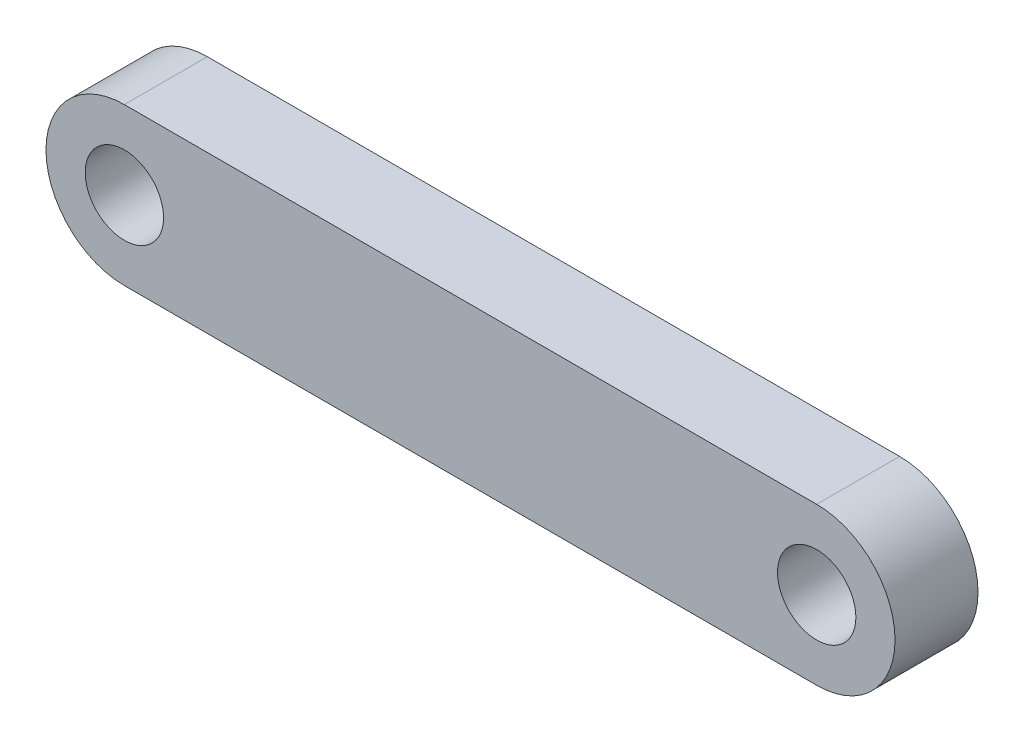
ISO-10303-21;
HEADER;
FILE_DESCRIPTION(('STEP AP214'),'2;1');
FILE_NAME('part.step','',(''),(''),'','','');
FILE_SCHEMA(('AUTOMOTIVE_DESIGN { 1 0 10303 214 1 1 1 1 }'));
ENDSEC;
DATA;
#1=APPLICATION_CONTEXT('core data for automotive mechanical design processes');
#2=APPLICATION_PROTOCOL_DEFINITION('international standard','automotive_design',2000,#1);
#3=PRODUCT_CONTEXT('',#1,'mechanical');
#4=PRODUCT('Part','Part','',(#3));
#5=PRODUCT_RELATED_PRODUCT_CATEGORY('part','',(#4));
#6=PRODUCT_DEFINITION_FORMATION('','',#4);
#7=PRODUCT_DEFINITION_CONTEXT('part definition',#1,'design');
#8=PRODUCT_DEFINITION('design','',#6,#7);
#9=PRODUCT_DEFINITION_SHAPE('','',#8);
#10=(LENGTH_UNIT() NAMED_UNIT(*) SI_UNIT(.MILLI.,.METRE.));
#11=(NAMED_UNIT(*) PLANE_ANGLE_UNIT() SI_UNIT($,.RADIAN.));
#12=(NAMED_UNIT(*) SI_UNIT($,.STERADIAN.) SOLID_ANGLE_UNIT());
#13=UNCERTAINTY_MEASURE_WITH_UNIT(LENGTH_MEASURE(1.E-05),#10,'distance_accuracy_value','');
#14=(GEOMETRIC_REPRESENTATION_CONTEXT(3) GLOBAL_UNCERTAINTY_ASSIGNED_CONTEXT((#13)) GLOBAL_UNIT_ASSIGNED_CONTEXT((#10,
#11,#12)) REPRESENTATION_CONTEXT('',''));
#15=CARTESIAN_POINT('',(0.,0.,0.));
#16=DIRECTION('',(0.,0.,1.));
#17=DIRECTION('',(1.,0.,0.));
#18=AXIS2_PLACEMENT_3D('',#15,#16,#17);
#19=CARTESIAN_POINT('',(-53.,0.,12.7));
#20=DIRECTION('',(0.,0.,1.));
#21=DIRECTION('',(1.,0.,0.));
#22=AXIS2_PLACEMENT_3D('',#19,#20,#21);
#23=PLANE('',#22);
#24=CARTESIAN_POINT('',(-53.,0.,12.7));
#25=DIRECTION('',(0.,0.,1.));
#26=DIRECTION('',(1.,0.,0.));
#27=AXIS2_PLACEMENT_3D('',#24,#25,#26);
#28=CIRCLE('',#27,5.99999999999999);
#29=CARTESIAN_POINT('',(-47.,0.,12.7));
#30=VERTEX_POINT('',#29);
#31=EDGE_CURVE('E118',#30,#30,#28,.T.);
#32=ORIENTED_EDGE('',*,*,#31,.F.);
#33=EDGE_LOOP('',(#32));
#34=FACE_BOUND('',#33,.T.);
#35=CARTESIAN_POINT('',(-53.,0.,12.7));
#36=DIRECTION('',(0.,0.,1.));
#37=DIRECTION('',(1.,0.,0.));
#38=AXIS2_PLACEMENT_3D('',#35,#36,#37);
#39=CIRCLE('',#38,12.);
#40=CARTESIAN_POINT('',(-53.,12.,12.7));
#41=VERTEX_POINT('',#40);
#42=CARTESIAN_POINT('',(-53.,-12.,12.7));
#43=VERTEX_POINT('',#42);
#44=EDGE_CURVE('E98',#41,#43,#39,.T.);
#45=ORIENTED_EDGE('',*,*,#44,.T.);
#46=DIRECTION('',(1.,0.,0.));
#47=VECTOR('',#46,1.);
#48=CARTESIAN_POINT('',(-53.,-12.,12.7));
#49=LINE('',#48,#47);
#50=CARTESIAN_POINT('',(53.,-12.,12.7));
#51=VERTEX_POINT('',#50);
#52=EDGE_CURVE('E93',#43,#51,#49,.T.);
#53=ORIENTED_EDGE('',*,*,#52,.T.);
#54=CARTESIAN_POINT('',(53.,0.,12.7));
#55=DIRECTION('',(0.,0.,1.));
#56=DIRECTION('',(1.,0.,0.));
#57=AXIS2_PLACEMENT_3D('',#54,#55,#56);
#58=CIRCLE('',#57,12.);
#59=CARTESIAN_POINT('',(53.,12.,12.7));
#60=VERTEX_POINT('',#59);
#61=EDGE_CURVE('E96',#51,#60,#58,.T.);
#62=ORIENTED_EDGE('',*,*,#61,.T.);
#63=DIRECTION('',(-1.,0.,0.));
#64=VECTOR('',#63,1.);
#65=CARTESIAN_POINT('',(-53.,12.,12.7));
#66=LINE('',#65,#64);
#67=EDGE_CURVE('E63',#60,#41,#66,.T.);
#68=ORIENTED_EDGE('',*,*,#67,.T.);
#69=EDGE_LOOP('',(#45,#53,#62,#68));
#70=FACE_BOUND('',#69,.T.);
#71=CARTESIAN_POINT('',(53.,0.,12.7));
#72=DIRECTION('',(0.,0.,1.));
#73=DIRECTION('',(1.,0.,0.));
#74=AXIS2_PLACEMENT_3D('',#71,#72,#73);
#75=CIRCLE('',#74,5.99999999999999);
#76=CARTESIAN_POINT('',(59.,0.,12.7));
#77=VERTEX_POINT('',#76);
#78=EDGE_CURVE('E140',#77,#77,#75,.T.);
#79=ORIENTED_EDGE('',*,*,#78,.F.);
#80=EDGE_LOOP('',(#79));
#81=FACE_BOUND('',#80,.T.);
#82=ADVANCED_FACE('F45',(#34,#70,#81),#23,.T.);
#83=CARTESIAN_POINT('',(-53.,0.,0.));
#84=DIRECTION('',(0.,0.,1.));
#85=DIRECTION('',(1.,0.,0.));
#86=AXIS2_PLACEMENT_3D('',#83,#84,#85);
#87=PLANE('',#86);
#88=CARTESIAN_POINT('',(-53.,0.,0.));
#89=DIRECTION('',(0.,0.,1.));
#90=DIRECTION('',(1.,0.,0.));
#91=AXIS2_PLACEMENT_3D('',#88,#89,#90);
#92=CIRCLE('',#91,12.);
#93=CARTESIAN_POINT('',(-53.,12.,0.));
#94=VERTEX_POINT('',#93);
#95=CARTESIAN_POINT('',(-53.,-12.,0.));
#96=VERTEX_POINT('',#95);
#97=EDGE_CURVE('E114',#94,#96,#92,.T.);
#98=ORIENTED_EDGE('',*,*,#97,.F.);
#99=DIRECTION('',(-1.,0.,0.));
#100=VECTOR('',#99,1.);
#101=CARTESIAN_POINT('',(-53.,12.,0.));
#102=LINE('',#101,#100);
#103=CARTESIAN_POINT('',(53.,12.,0.));
#104=VERTEX_POINT('',#103);
#105=EDGE_CURVE('E86',#104,#94,#102,.T.);
#106=ORIENTED_EDGE('',*,*,#105,.F.);
#107=CARTESIAN_POINT('',(53.,0.,0.));
#108=DIRECTION('',(0.,0.,1.));
#109=DIRECTION('',(1.,0.,0.));
#110=AXIS2_PLACEMENT_3D('',#107,#108,#109);
#111=CIRCLE('',#110,12.);
#112=CARTESIAN_POINT('',(53.,-12.,0.));
#113=VERTEX_POINT('',#112);
#114=EDGE_CURVE('E80',#113,#104,#111,.T.);
#115=ORIENTED_EDGE('',*,*,#114,.F.);
#116=DIRECTION('',(1.,0.,0.));
#117=VECTOR('',#116,1.);
#118=CARTESIAN_POINT('',(-53.,-12.,0.));
#119=LINE('',#118,#117);
#120=EDGE_CURVE('E103',#96,#113,#119,.T.);
#121=ORIENTED_EDGE('',*,*,#120,.F.);
#122=EDGE_LOOP('',(#98,#106,#115,#121));
#123=FACE_BOUND('',#122,.T.);
#124=CARTESIAN_POINT('',(-53.,0.,0.));
#125=DIRECTION('',(0.,0.,1.));
#126=DIRECTION('',(1.,0.,0.));
#127=AXIS2_PLACEMENT_3D('',#124,#125,#126);
#128=CIRCLE('',#127,5.99999999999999);
#129=CARTESIAN_POINT('',(-47.,0.,0.));
#130=VERTEX_POINT('',#129);
#131=EDGE_CURVE('E136',#130,#130,#128,.T.);
#132=ORIENTED_EDGE('',*,*,#131,.T.);
#133=EDGE_LOOP('',(#132));
#134=FACE_BOUND('',#133,.T.);
#135=CARTESIAN_POINT('',(53.,0.,0.));
#136=DIRECTION('',(0.,0.,1.));
#137=DIRECTION('',(1.,0.,0.));
#138=AXIS2_PLACEMENT_3D('',#135,#136,#137);
#139=CIRCLE('',#138,5.99999999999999);
#140=CARTESIAN_POINT('',(59.,0.,0.));
#141=VERTEX_POINT('',#140);
#142=EDGE_CURVE('E144',#141,#141,#139,.T.);
#143=ORIENTED_EDGE('',*,*,#142,.T.);
#144=EDGE_LOOP('',(#143));
#145=FACE_BOUND('',#144,.T.);
#146=ADVANCED_FACE('F131',(#123,#134,#145),#87,.F.);
#147=CARTESIAN_POINT('',(-53.,0.,12.7));
#148=DIRECTION('',(0.,0.,-1.));
#149=DIRECTION('',(-1.,0.,0.));
#150=AXIS2_PLACEMENT_3D('',#147,#148,#149);
#151=CYLINDRICAL_SURFACE('',#150,12.);
#152=ORIENTED_EDGE('',*,*,#97,.T.);
#153=DIRECTION('',(0.,0.,-1.));
#154=VECTOR('',#153,1.);
#155=CARTESIAN_POINT('',(-53.,-12.,12.7));
#156=LINE('',#155,#154);
#157=EDGE_CURVE('E11',#43,#96,#156,.T.);
#158=ORIENTED_EDGE('',*,*,#157,.F.);
#159=ORIENTED_EDGE('',*,*,#44,.F.);
#160=DIRECTION('',(0.,0.,-1.));
#161=VECTOR('',#160,1.);
#162=CARTESIAN_POINT('',(-53.,12.,12.7));
#163=LINE('',#162,#161);
#164=EDGE_CURVE('E110',#41,#94,#163,.T.);
#165=ORIENTED_EDGE('',*,*,#164,.T.);
#166=EDGE_LOOP('',(#152,#158,#159,#165));
#167=FACE_BOUND('',#166,.T.);
#168=ADVANCED_FACE('F47',(#167),#151,.T.);
#169=CARTESIAN_POINT('',(-53.,-12.,12.7));
#170=DIRECTION('',(0.,1.,0.));
#171=DIRECTION('',(-1.,0.,0.));
#172=AXIS2_PLACEMENT_3D('',#169,#170,#171);
#173=PLANE('',#172);
#174=ORIENTED_EDGE('',*,*,#120,.T.);
#175=DIRECTION('',(0.,0.,-1.));
#176=VECTOR('',#175,1.);
#177=CARTESIAN_POINT('',(53.,-12.,12.7));
#178=LINE('',#177,#176);
#179=EDGE_CURVE('E55',#51,#113,#178,.T.);
#180=ORIENTED_EDGE('',*,*,#179,.F.);
#181=ORIENTED_EDGE('',*,*,#52,.F.);
#182=ORIENTED_EDGE('',*,*,#157,.T.);
#183=EDGE_LOOP('',(#174,#180,#181,#182));
#184=FACE_BOUND('',#183,.T.);
#185=ADVANCED_FACE('F102',(#184),#173,.F.);
#186=CARTESIAN_POINT('',(53.,0.,12.7));
#187=DIRECTION('',(0.,0.,-1.));
#188=DIRECTION('',(-1.,0.,0.));
#189=AXIS2_PLACEMENT_3D('',#186,#187,#188);
#190=CYLINDRICAL_SURFACE('',#189,12.);
#191=ORIENTED_EDGE('',*,*,#114,.T.);
#192=DIRECTION('',(0.,0.,-1.));
#193=VECTOR('',#192,1.);
#194=CARTESIAN_POINT('',(53.,12.,12.7));
#195=LINE('',#194,#193);
#196=EDGE_CURVE('E105',#60,#104,#195,.T.);
#197=ORIENTED_EDGE('',*,*,#196,.F.);
#198=ORIENTED_EDGE('',*,*,#61,.F.);
#199=ORIENTED_EDGE('',*,*,#179,.T.);
#200=EDGE_LOOP('',(#191,#197,#198,#199));
#201=FACE_BOUND('',#200,.T.);
#202=ADVANCED_FACE('F106',(#201),#190,.T.);
#203=CARTESIAN_POINT('',(-53.,12.,12.7));
#204=DIRECTION('',(0.,-1.,0.));
#205=DIRECTION('',(1.,0.,0.));
#206=AXIS2_PLACEMENT_3D('',#203,#204,#205);
#207=PLANE('',#206);
#208=ORIENTED_EDGE('',*,*,#105,.T.);
#209=ORIENTED_EDGE('',*,*,#164,.F.);
#210=ORIENTED_EDGE('',*,*,#67,.F.);
#211=ORIENTED_EDGE('',*,*,#196,.T.);
#212=EDGE_LOOP('',(#208,#209,#210,#211));
#213=FACE_BOUND('',#212,.T.);
#214=ADVANCED_FACE('F128',(#213),#207,.F.);
#215=CARTESIAN_POINT('',(-53.,0.,12.7));
#216=DIRECTION('',(0.,0.,-1.));
#217=DIRECTION('',(-1.,0.,0.));
#218=AXIS2_PLACEMENT_3D('',#215,#216,#217);
#219=CYLINDRICAL_SURFACE('',#218,5.99999999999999);
#220=ORIENTED_EDGE('',*,*,#31,.T.);
#221=EDGE_LOOP('',(#220));
#222=FACE_BOUND('',#221,.T.);
#223=ORIENTED_EDGE('',*,*,#131,.F.);
#224=EDGE_LOOP('',(#223));
#225=FACE_BOUND('',#224,.T.);
#226=ADVANCED_FACE('F163',(#222,#225),#219,.F.);
#227=CARTESIAN_POINT('',(53.,0.,12.7));
#228=DIRECTION('',(0.,0.,-1.));
#229=DIRECTION('',(-1.,0.,0.));
#230=AXIS2_PLACEMENT_3D('',#227,#228,#229);
#231=CYLINDRICAL_SURFACE('',#230,5.99999999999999);
#232=ORIENTED_EDGE('',*,*,#78,.T.);
#233=EDGE_LOOP('',(#232));
#234=FACE_BOUND('',#233,.T.);
#235=ORIENTED_EDGE('',*,*,#142,.F.);
#236=EDGE_LOOP('',(#235));
#237=FACE_BOUND('',#236,.T.);
#238=ADVANCED_FACE('F152',(#234,#237),#231,.F.);
#239=CLOSED_SHELL('',(#82,#146,#168,#185,#202,#214,#226,#238));
#240=MANIFOLD_SOLID_BREP('B2',#239);
#241=ADVANCED_BREP_SHAPE_REPRESENTATION('',(#18,#240),#14);
#242=SHAPE_DEFINITION_REPRESENTATION(#9,#241);
ENDSEC;
END-ISO-10303-21;
